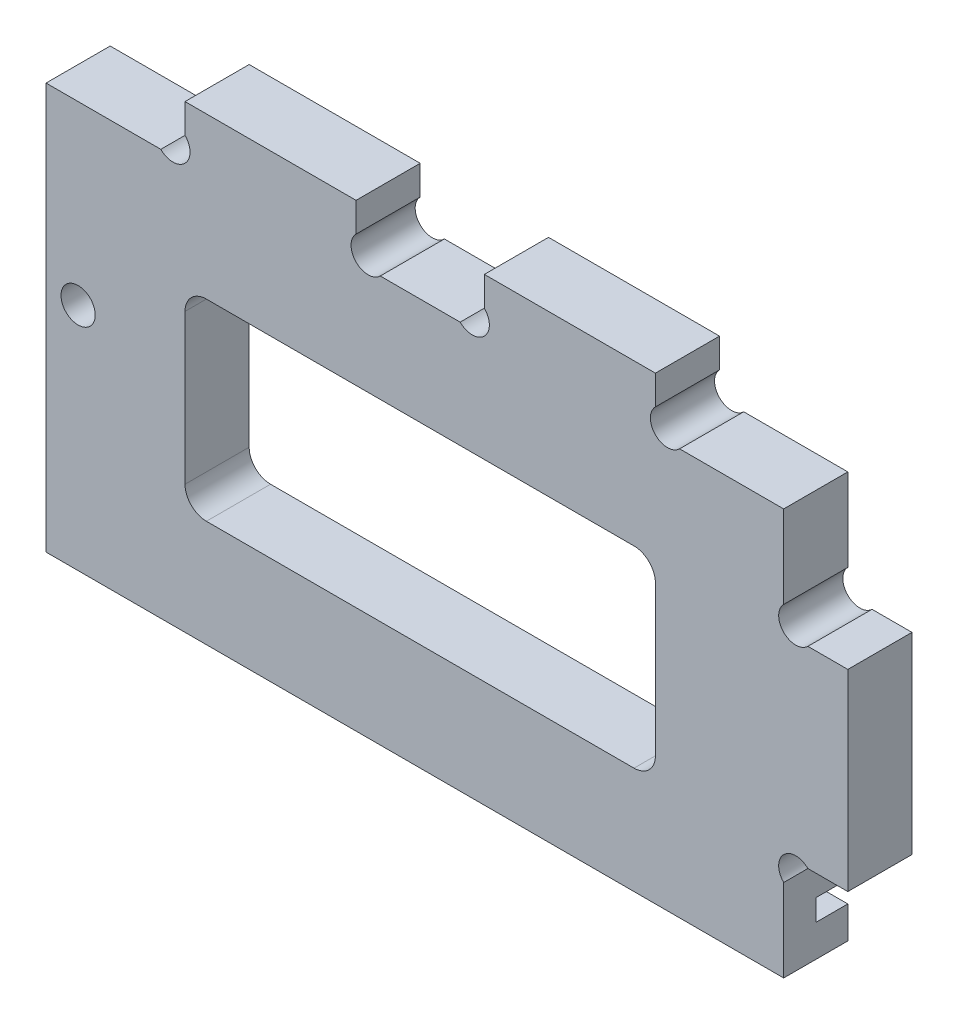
from build123d import *

# Parameters (mm, degrees)
ESQUISSE1_R             = 1.6
EXTRUSION1_DEPTH        = 6
ESQUISSE2_W             = 69.045421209
ESQUISSE2_H             = 2
ENL_V_MAT_EXTRU_1_DEPTH = 3


with BuildPart() as part:
    # Esquisse1 → Extrusion1 (new body)
    with BuildSketch(Plane.XY):
        with BuildLine():
            Line((32, 40.2627417), (32, 43))
            Line((32, 43), (16, 43))
            Line((16, 43), (16, 40.2627417))
            ThreePointArc((16, 40.2627417), (16, 38), (13.7372583, 38))
            Line((13.7372583, 38), (6.2627417, 38))
            ThreePointArc((6.2627417, 38), (4, 38), (4, 40.2627417))
            Line((4, 40.2627417), (4, 43))
            Line((4, 43), (-12, 43))
            Line((-12, 43), (-12, 40.2627417))
            ThreePointArc((-12, 40.2627417), (-12, 38), (-14.2627417, 38))
            Line((-14.2627417, 38), (-25, 38))
            Line((-25, 38), (-25, 0))
            Line((-25, 0), (44, 0))
            Line((44, 0), (44, 7.7372583))
            ThreePointArc((44, 7.7372583), (44, 10), (46.2627417, 10))
            Line((46.2627417, 10), (50, 10))
            Line((50, 10), (50, 28))
            Line((50, 28), (46.2627417, 28))
            ThreePointArc((46.2627417, 28), (44, 28), (44, 30.2627417))
            Line((44, 30.2627417), (44, 38))
            Line((44, 38), (34.2627417, 38))
            ThreePointArc((34.2627417, 38), (32, 38), (32, 40.2627417))
        make_face()
        with Locations((-22, 21.5)):
            Circle(ESQUISSE1_R, mode=Mode.SUBTRACT)
        with BuildLine():
            Line((-10, 28), (30, 28))
            ThreePointArc((30, 28), (31.414213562, 27.414213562), (32, 26))
            Line((32, 26), (32, 12))
            ThreePointArc((32, 12), (31.414213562, 10.585786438), (30, 10))
            Line((30, 10), (-10, 10))
            ThreePointArc((-10, 10), (-11.414213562, 10.585786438), (-12, 12))
            Line((-12, 12), (-12, 26))
            ThreePointArc((-12, 26), (-11.414213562, 27.414213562), (-10, 28))
        make_face(mode=Mode.SUBTRACT)
    extrude(amount=EXTRUSION1_DEPTH)

    # Esquisse2 → Enl_v. mat.-Extru.1 (cut)
    with BuildSketch(Plane(origin=(0, 0, 0), x_dir=(-1, 0, 0), z_dir=(0, 0, -1))):
        with Locations((-9.477289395, 4)):
            Rectangle(ESQUISSE2_W, ESQUISSE2_H)
    extrude(amount=-ENL_V_MAT_EXTRU_1_DEPTH, mode=Mode.SUBTRACT)


solid = part.part
